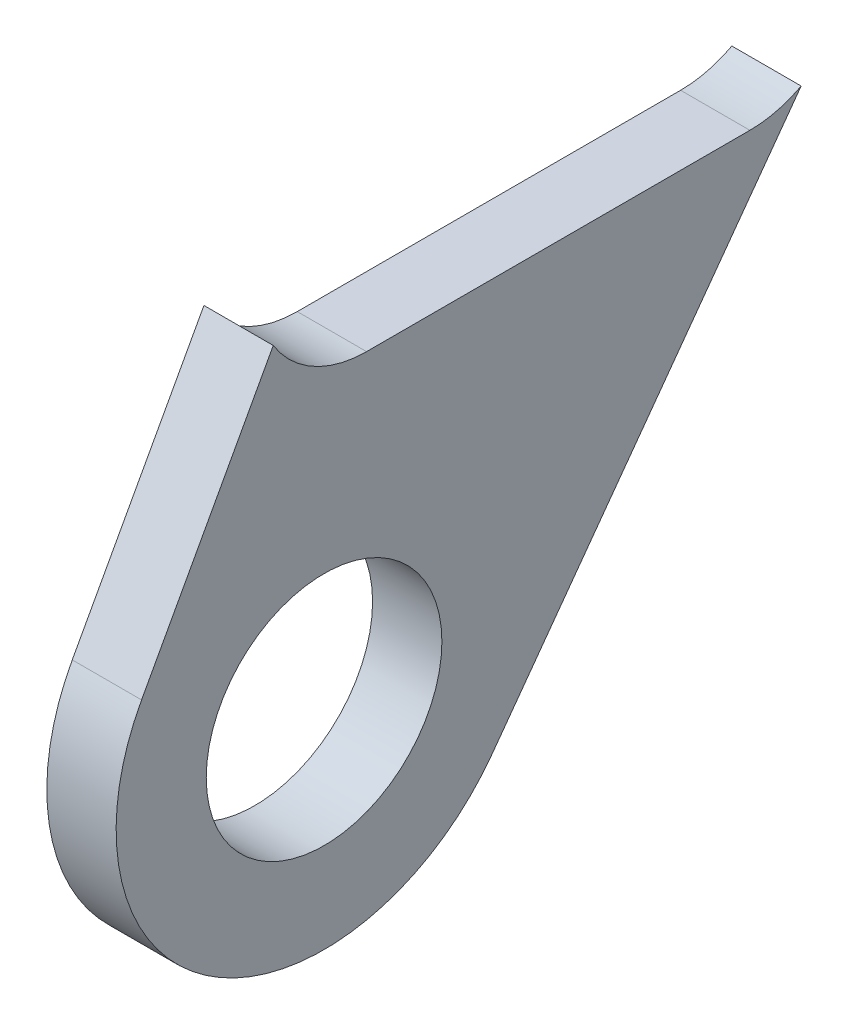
ISO-10303-21;
HEADER;
FILE_DESCRIPTION(('STEP AP214'),'2;1');
FILE_NAME('part.step','',(''),(''),'','','');
FILE_SCHEMA(('AUTOMOTIVE_DESIGN { 1 0 10303 214 1 1 1 1 }'));
ENDSEC;
DATA;
#1=APPLICATION_CONTEXT('core data for automotive mechanical design processes');
#2=APPLICATION_PROTOCOL_DEFINITION('international standard','automotive_design',2000,#1);
#3=PRODUCT_CONTEXT('',#1,'mechanical');
#4=PRODUCT('Part','Part','',(#3));
#5=PRODUCT_RELATED_PRODUCT_CATEGORY('part','',(#4));
#6=PRODUCT_DEFINITION_FORMATION('','',#4);
#7=PRODUCT_DEFINITION_CONTEXT('part definition',#1,'design');
#8=PRODUCT_DEFINITION('design','',#6,#7);
#9=PRODUCT_DEFINITION_SHAPE('','',#8);
#10=(LENGTH_UNIT() NAMED_UNIT(*) SI_UNIT(.MILLI.,.METRE.));
#11=(NAMED_UNIT(*) PLANE_ANGLE_UNIT() SI_UNIT($,.RADIAN.));
#12=(NAMED_UNIT(*) SI_UNIT($,.STERADIAN.) SOLID_ANGLE_UNIT());
#13=UNCERTAINTY_MEASURE_WITH_UNIT(LENGTH_MEASURE(1.E-05),#10,'distance_accuracy_value','');
#14=(GEOMETRIC_REPRESENTATION_CONTEXT(3) GLOBAL_UNCERTAINTY_ASSIGNED_CONTEXT((#13)) GLOBAL_UNIT_ASSIGNED_CONTEXT((#10,
#11,#12)) REPRESENTATION_CONTEXT('',''));
#15=CARTESIAN_POINT('',(0.,0.,0.));
#16=DIRECTION('',(0.,0.,1.));
#17=DIRECTION('',(1.,0.,0.));
#18=AXIS2_PLACEMENT_3D('',#15,#16,#17);
#19=CARTESIAN_POINT('',(6.,0.,0.));
#20=DIRECTION('',(1.,0.,0.));
#21=DIRECTION('',(0.,0.,-1.));
#22=AXIS2_PLACEMENT_3D('',#19,#20,#21);
#23=PLANE('',#22);
#24=CARTESIAN_POINT('',(6.,0.,0.));
#25=DIRECTION('',(1.,0.,0.));
#26=DIRECTION('',(0.,0.,-1.));
#27=AXIS2_PLACEMENT_3D('',#24,#25,#26);
#28=CIRCLE('',#27,18.);
#29=CARTESIAN_POINT('',(6.,8.62672577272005,15.7980885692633));
#30=VERTEX_POINT('',#29);
#31=CARTESIAN_POINT('',(6.,-10.6029589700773,-14.5456956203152));
#32=VERTEX_POINT('',#31);
#33=EDGE_CURVE('E116',#30,#32,#28,.T.);
#34=ORIENTED_EDGE('',*,*,#33,.T.);
#35=DIRECTION('',(0.,0.808094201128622,-0.589053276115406));
#36=VECTOR('',#35,1.);
#37=CARTESIAN_POINT('',(6.,26.1,-41.3));
#38=LINE('',#37,#36);
#39=CARTESIAN_POINT('',(6.,26.1,-41.3));
#40=VERTEX_POINT('',#39);
#41=EDGE_CURVE('E97',#32,#40,#38,.T.);
#42=ORIENTED_EDGE('',*,*,#41,.T.);
#43=CARTESIAN_POINT('',(6.,34.5,-36.8626584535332));
#44=DIRECTION('',(-1.,0.,0.));
#45=DIRECTION('',(0.,0.,-1.));
#46=AXIS2_PLACEMENT_3D('',#43,#44,#45);
#47=CIRCLE('',#46,9.5);
#48=CARTESIAN_POINT('',(6.,25.,-36.8626584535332));
#49=VERTEX_POINT('',#48);
#50=EDGE_CURVE('E119',#40,#49,#47,.T.);
#51=ORIENTED_EDGE('',*,*,#50,.T.);
#52=DIRECTION('',(0.,0.,1.));
#53=VECTOR('',#52,1.);
#54=CARTESIAN_POINT('',(6.,25.,-3.67774721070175));
#55=LINE('',#54,#53);
#56=CARTESIAN_POINT('',(6.,25.,-3.67774721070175));
#57=VERTEX_POINT('',#56);
#58=EDGE_CURVE('E121',#49,#57,#55,.T.);
#59=ORIENTED_EDGE('',*,*,#58,.T.);
#60=CARTESIAN_POINT('',(6.,34.5,-3.67774721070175));
#61=DIRECTION('',(-1.,0.,0.));
#62=DIRECTION('',(0.,0.,-1.));
#63=AXIS2_PLACEMENT_3D('',#60,#61,#62);
#64=CIRCLE('',#63,9.5);
#65=CARTESIAN_POINT('',(6.,29.5,4.4));
#66=VERTEX_POINT('',#65);
#67=EDGE_CURVE('E50',#57,#66,#64,.T.);
#68=ORIENTED_EDGE('',*,*,#67,.T.);
#69=DIRECTION('',(0.,-0.877671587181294,0.479262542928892));
#70=VECTOR('',#69,1.);
#71=CARTESIAN_POINT('',(6.,8.62672577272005,15.7980885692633));
#72=LINE('',#71,#70);
#73=EDGE_CURVE('E45',#66,#30,#72,.T.);
#74=ORIENTED_EDGE('',*,*,#73,.T.);
#75=EDGE_LOOP('',(#34,#42,#51,#59,#68,#74));
#76=FACE_BOUND('',#75,.T.);
#77=CARTESIAN_POINT('',(6.,0.,0.));
#78=DIRECTION('',(1.,0.,0.));
#79=DIRECTION('',(0.,0.,-1.));
#80=AXIS2_PLACEMENT_3D('',#77,#78,#79);
#81=CIRCLE('',#80,10.2);
#82=CARTESIAN_POINT('',(6.,0.,-10.2));
#83=VERTEX_POINT('',#82);
#84=EDGE_CURVE('E102',#83,#83,#81,.T.);
#85=ORIENTED_EDGE('',*,*,#84,.F.);
#86=EDGE_LOOP('',(#85));
#87=FACE_BOUND('',#86,.T.);
#88=ADVANCED_FACE('F30',(#76,#87),#23,.T.);
#89=CARTESIAN_POINT('',(0.,0.,0.));
#90=DIRECTION('',(1.,0.,0.));
#91=DIRECTION('',(0.,0.,-1.));
#92=AXIS2_PLACEMENT_3D('',#89,#90,#91);
#93=PLANE('',#92);
#94=CARTESIAN_POINT('',(0.,0.,0.));
#95=DIRECTION('',(1.,0.,0.));
#96=DIRECTION('',(0.,0.,-1.));
#97=AXIS2_PLACEMENT_3D('',#94,#95,#96);
#98=CIRCLE('',#97,18.);
#99=CARTESIAN_POINT('',(0.,8.62672577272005,15.7980885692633));
#100=VERTEX_POINT('',#99);
#101=CARTESIAN_POINT('',(0.,-10.6029589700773,-14.5456956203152));
#102=VERTEX_POINT('',#101);
#103=EDGE_CURVE('E88',#100,#102,#98,.T.);
#104=ORIENTED_EDGE('',*,*,#103,.F.);
#105=DIRECTION('',(0.,-0.877671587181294,0.479262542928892));
#106=VECTOR('',#105,1.);
#107=CARTESIAN_POINT('',(0.,8.62672577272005,15.7980885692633));
#108=LINE('',#107,#106);
#109=CARTESIAN_POINT('',(0.,29.5,4.4));
#110=VERTEX_POINT('',#109);
#111=EDGE_CURVE('E114',#110,#100,#108,.T.);
#112=ORIENTED_EDGE('',*,*,#111,.F.);
#113=CARTESIAN_POINT('',(0.,34.5,-3.67774721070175));
#114=DIRECTION('',(-1.,0.,0.));
#115=DIRECTION('',(0.,0.,-1.));
#116=AXIS2_PLACEMENT_3D('',#113,#114,#115);
#117=CIRCLE('',#116,9.5);
#118=CARTESIAN_POINT('',(0.,25.,-3.67774721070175));
#119=VERTEX_POINT('',#118);
#120=EDGE_CURVE('E112',#119,#110,#117,.T.);
#121=ORIENTED_EDGE('',*,*,#120,.F.);
#122=DIRECTION('',(0.,0.,1.));
#123=VECTOR('',#122,1.);
#124=CARTESIAN_POINT('',(0.,25.,-3.67774721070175));
#125=LINE('',#124,#123);
#126=CARTESIAN_POINT('',(0.,25.,-36.8626584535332));
#127=VERTEX_POINT('',#126);
#128=EDGE_CURVE('E110',#127,#119,#125,.T.);
#129=ORIENTED_EDGE('',*,*,#128,.F.);
#130=CARTESIAN_POINT('',(0.,34.5,-36.8626584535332));
#131=DIRECTION('',(-1.,0.,0.));
#132=DIRECTION('',(0.,0.,-1.));
#133=AXIS2_PLACEMENT_3D('',#130,#131,#132);
#134=CIRCLE('',#133,9.5);
#135=CARTESIAN_POINT('',(0.,26.1,-41.3));
#136=VERTEX_POINT('',#135);
#137=EDGE_CURVE('E90',#136,#127,#134,.T.);
#138=ORIENTED_EDGE('',*,*,#137,.F.);
#139=DIRECTION('',(0.,0.808094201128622,-0.589053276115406));
#140=VECTOR('',#139,1.);
#141=CARTESIAN_POINT('',(0.,26.1,-41.3));
#142=LINE('',#141,#140);
#143=EDGE_CURVE('E83',#102,#136,#142,.T.);
#144=ORIENTED_EDGE('',*,*,#143,.F.);
#145=EDGE_LOOP('',(#104,#112,#121,#129,#138,#144));
#146=FACE_BOUND('',#145,.T.);
#147=CARTESIAN_POINT('',(0.,0.,0.));
#148=DIRECTION('',(1.,0.,0.));
#149=DIRECTION('',(0.,0.,-1.));
#150=AXIS2_PLACEMENT_3D('',#147,#148,#149);
#151=CIRCLE('',#150,10.2);
#152=CARTESIAN_POINT('',(0.,0.,-10.2));
#153=VERTEX_POINT('',#152);
#154=EDGE_CURVE('E105',#153,#153,#151,.T.);
#155=ORIENTED_EDGE('',*,*,#154,.T.);
#156=EDGE_LOOP('',(#155));
#157=FACE_BOUND('',#156,.T.);
#158=ADVANCED_FACE('F84',(#146,#157),#93,.F.);
#159=CARTESIAN_POINT('',(6.,0.,0.));
#160=DIRECTION('',(-1.,0.,0.));
#161=DIRECTION('',(0.,0.,1.));
#162=AXIS2_PLACEMENT_3D('',#159,#160,#161);
#163=CYLINDRICAL_SURFACE('',#162,18.);
#164=ORIENTED_EDGE('',*,*,#103,.T.);
#165=DIRECTION('',(-1.,0.,0.));
#166=VECTOR('',#165,1.);
#167=CARTESIAN_POINT('',(6.,-10.6029589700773,-14.5456956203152));
#168=LINE('',#167,#166);
#169=EDGE_CURVE('E11',#32,#102,#168,.T.);
#170=ORIENTED_EDGE('',*,*,#169,.F.);
#171=ORIENTED_EDGE('',*,*,#33,.F.);
#172=DIRECTION('',(-1.,0.,0.));
#173=VECTOR('',#172,1.);
#174=CARTESIAN_POINT('',(6.,8.62672577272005,15.7980885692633));
#175=LINE('',#174,#173);
#176=EDGE_CURVE('E101',#30,#100,#175,.T.);
#177=ORIENTED_EDGE('',*,*,#176,.T.);
#178=EDGE_LOOP('',(#164,#170,#171,#177));
#179=FACE_BOUND('',#178,.T.);
#180=ADVANCED_FACE('F32',(#179),#163,.T.);
#181=CARTESIAN_POINT('',(6.,26.1,-41.3));
#182=DIRECTION('',(0.,0.589053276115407,0.808094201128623));
#183=DIRECTION('',(0.,-0.808094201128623,0.589053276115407));
#184=AXIS2_PLACEMENT_3D('',#181,#182,#183);
#185=PLANE('',#184);
#186=ORIENTED_EDGE('',*,*,#143,.T.);
#187=DIRECTION('',(-1.,0.,0.));
#188=VECTOR('',#187,1.);
#189=CARTESIAN_POINT('',(6.,26.1,-41.3));
#190=LINE('',#189,#188);
#191=EDGE_CURVE('E38',#40,#136,#190,.T.);
#192=ORIENTED_EDGE('',*,*,#191,.F.);
#193=ORIENTED_EDGE('',*,*,#41,.F.);
#194=ORIENTED_EDGE('',*,*,#169,.T.);
#195=EDGE_LOOP('',(#186,#192,#193,#194));
#196=FACE_BOUND('',#195,.T.);
#197=ADVANCED_FACE('F96',(#196),#185,.F.);
#198=CARTESIAN_POINT('',(6.,34.5,-36.8626584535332));
#199=DIRECTION('',(-1.,0.,0.));
#200=DIRECTION('',(0.,0.,1.));
#201=AXIS2_PLACEMENT_3D('',#198,#199,#200);
#202=CYLINDRICAL_SURFACE('',#201,9.5);
#203=ORIENTED_EDGE('',*,*,#137,.T.);
#204=DIRECTION('',(-1.,0.,0.));
#205=VECTOR('',#204,1.);
#206=CARTESIAN_POINT('',(6.,25.,-36.8626584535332));
#207=LINE('',#206,#205);
#208=EDGE_CURVE('E132',#49,#127,#207,.T.);
#209=ORIENTED_EDGE('',*,*,#208,.F.);
#210=ORIENTED_EDGE('',*,*,#50,.F.);
#211=ORIENTED_EDGE('',*,*,#191,.T.);
#212=EDGE_LOOP('',(#203,#209,#210,#211));
#213=FACE_BOUND('',#212,.T.);
#214=ADVANCED_FACE('F136',(#213),#202,.F.);
#215=CARTESIAN_POINT('',(6.,25.,-3.67774721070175));
#216=DIRECTION('',(0.,-1.,0.));
#217=DIRECTION('',(0.,0.,-1.));
#218=AXIS2_PLACEMENT_3D('',#215,#216,#217);
#219=PLANE('',#218);
#220=ORIENTED_EDGE('',*,*,#128,.T.);
#221=DIRECTION('',(-1.,0.,0.));
#222=VECTOR('',#221,1.);
#223=CARTESIAN_POINT('',(6.,25.,-3.67774721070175));
#224=LINE('',#223,#222);
#225=EDGE_CURVE('E129',#57,#119,#224,.T.);
#226=ORIENTED_EDGE('',*,*,#225,.F.);
#227=ORIENTED_EDGE('',*,*,#58,.F.);
#228=ORIENTED_EDGE('',*,*,#208,.T.);
#229=EDGE_LOOP('',(#220,#226,#227,#228));
#230=FACE_BOUND('',#229,.T.);
#231=ADVANCED_FACE('F142',(#230),#219,.F.);
#232=CARTESIAN_POINT('',(6.,34.5,-3.67774721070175));
#233=DIRECTION('',(-1.,0.,0.));
#234=DIRECTION('',(0.,0.,1.));
#235=AXIS2_PLACEMENT_3D('',#232,#233,#234);
#236=CYLINDRICAL_SURFACE('',#235,9.5);
#237=ORIENTED_EDGE('',*,*,#120,.T.);
#238=DIRECTION('',(-1.,0.,0.));
#239=VECTOR('',#238,1.);
#240=CARTESIAN_POINT('',(6.,29.5,4.4));
#241=LINE('',#240,#239);
#242=EDGE_CURVE('E126',#66,#110,#241,.T.);
#243=ORIENTED_EDGE('',*,*,#242,.F.);
#244=ORIENTED_EDGE('',*,*,#67,.F.);
#245=ORIENTED_EDGE('',*,*,#225,.T.);
#246=EDGE_LOOP('',(#237,#243,#244,#245));
#247=FACE_BOUND('',#246,.T.);
#248=ADVANCED_FACE('F145',(#247),#236,.F.);
#249=CARTESIAN_POINT('',(6.,8.62672577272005,15.7980885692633));
#250=DIRECTION('',(0.,-0.479262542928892,-0.877671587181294));
#251=DIRECTION('',(0.,0.877671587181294,-0.479262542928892));
#252=AXIS2_PLACEMENT_3D('',#249,#250,#251);
#253=PLANE('',#252);
#254=ORIENTED_EDGE('',*,*,#111,.T.);
#255=ORIENTED_EDGE('',*,*,#176,.F.);
#256=ORIENTED_EDGE('',*,*,#73,.F.);
#257=ORIENTED_EDGE('',*,*,#242,.T.);
#258=EDGE_LOOP('',(#254,#255,#256,#257));
#259=FACE_BOUND('',#258,.T.);
#260=ADVANCED_FACE('F147',(#259),#253,.F.);
#261=CARTESIAN_POINT('',(6.,0.,0.));
#262=DIRECTION('',(-1.,0.,0.));
#263=DIRECTION('',(0.,0.,1.));
#264=AXIS2_PLACEMENT_3D('',#261,#262,#263);
#265=CYLINDRICAL_SURFACE('',#264,10.2);
#266=ORIENTED_EDGE('',*,*,#84,.T.);
#267=EDGE_LOOP('',(#266));
#268=FACE_BOUND('',#267,.T.);
#269=ORIENTED_EDGE('',*,*,#154,.F.);
#270=EDGE_LOOP('',(#269));
#271=FACE_BOUND('',#270,.T.);
#272=ADVANCED_FACE('F149',(#268,#271),#265,.F.);
#273=CLOSED_SHELL('',(#88,#158,#180,#197,#214,#231,#248,#260,#272));
#274=MANIFOLD_SOLID_BREP('B2',#273);
#275=ADVANCED_BREP_SHAPE_REPRESENTATION('',(#18,#274),#14);
#276=SHAPE_DEFINITION_REPRESENTATION(#9,#275);
ENDSEC;
END-ISO-10303-21;
